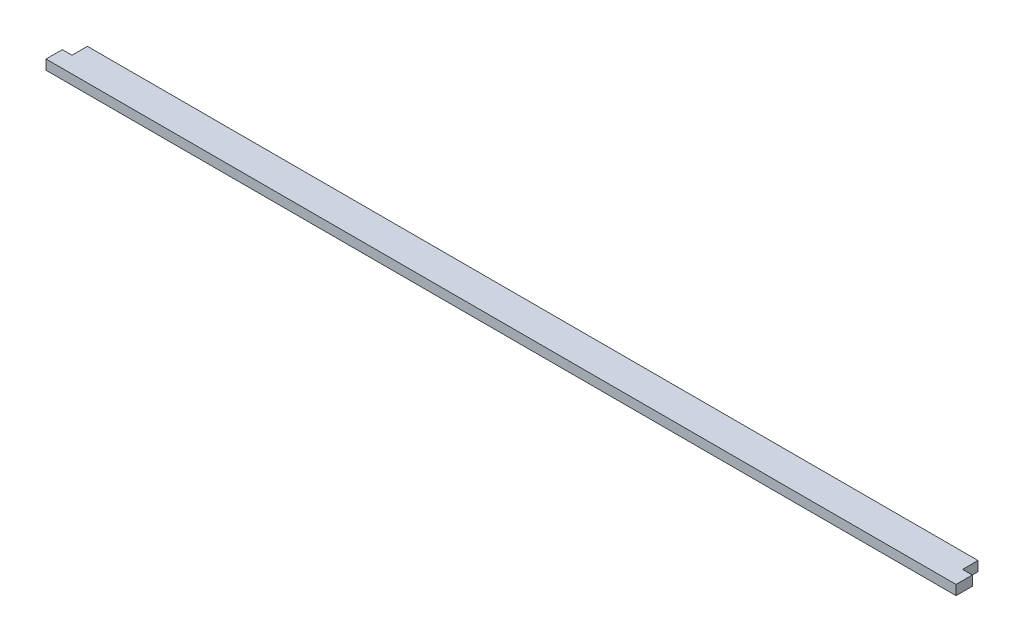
from build123d import *

# Parameters (mm, degrees)
SALIENTE_EXTRUIR1_DEPTH = 12
CROQUIS2_W              = 1096
CROQUIS2_H              = 1
CORTAR_EXTRUIR2_DEPTH   = 563.355759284


with BuildPart() as part:
    # Croquis1 → Saliente-Extruir1 (new body)
    with BuildSketch(Plane(origin=(0, 0, 0), x_dir=(1, 0, 0), z_dir=(0, 1, 0))):
        Polygon((-560, 10), (-560, 30), (-548, 30), (-548, 50), (548, 50), (548, 30), (560, 30), (560, 10), (548, 10), (-548, 10), align=None)
    extrude(amount=SALIENTE_EXTRUIR1_DEPTH)

    # Croquis2 → Cortar-Extruir2 (cut, through all)
    with BuildSketch(Plane(origin=(0, 0, 0), x_dir=(1, 0, 0), z_dir=(0, 1, 0))):
        with Locations((0, 49.5)):
            Rectangle(CROQUIS2_W, CROQUIS2_H)
    extrude(amount=CORTAR_EXTRUIR2_DEPTH, mode=Mode.SUBTRACT)


solid = part.part
